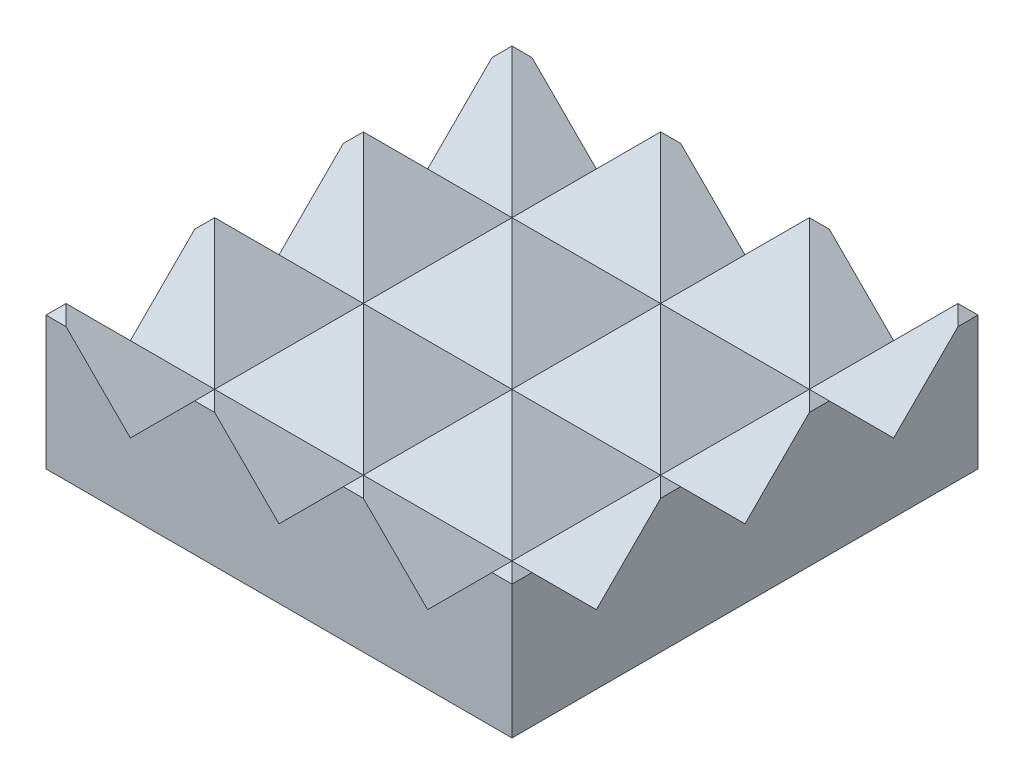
ISO-10303-21;
HEADER;
FILE_DESCRIPTION(('STEP AP214'),'2;1');
FILE_NAME('part.step','',(''),(''),'','','');
FILE_SCHEMA(('AUTOMOTIVE_DESIGN { 1 0 10303 214 1 1 1 1 }'));
ENDSEC;
DATA;
#1=APPLICATION_CONTEXT('core data for automotive mechanical design processes');
#2=APPLICATION_PROTOCOL_DEFINITION('international standard','automotive_design',2000,#1);
#3=PRODUCT_CONTEXT('',#1,'mechanical');
#4=PRODUCT('Part','Part','',(#3));
#5=PRODUCT_RELATED_PRODUCT_CATEGORY('part','',(#4));
#6=PRODUCT_DEFINITION_FORMATION('','',#4);
#7=PRODUCT_DEFINITION_CONTEXT('part definition',#1,'design');
#8=PRODUCT_DEFINITION('design','',#6,#7);
#9=PRODUCT_DEFINITION_SHAPE('','',#8);
#10=(LENGTH_UNIT() NAMED_UNIT(*) SI_UNIT(.MILLI.,.METRE.));
#11=(NAMED_UNIT(*) PLANE_ANGLE_UNIT() SI_UNIT($,.RADIAN.));
#12=(NAMED_UNIT(*) SI_UNIT($,.STERADIAN.) SOLID_ANGLE_UNIT());
#13=UNCERTAINTY_MEASURE_WITH_UNIT(LENGTH_MEASURE(1.E-05),#10,'distance_accuracy_value','');
#14=(GEOMETRIC_REPRESENTATION_CONTEXT(3) GLOBAL_UNCERTAINTY_ASSIGNED_CONTEXT((#13)) GLOBAL_UNIT_ASSIGNED_CONTEXT((#10,
#11,#12)) REPRESENTATION_CONTEXT('',''));
#15=CARTESIAN_POINT('',(0.,0.,0.));
#16=DIRECTION('',(0.,0.,1.));
#17=DIRECTION('',(1.,0.,0.));
#18=AXIS2_PLACEMENT_3D('',#15,#16,#17);
#19=CARTESIAN_POINT('',(-6.08,0.0699999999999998,-4.765));
#20=DIRECTION('',(0.707106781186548,-0.707106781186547,0.));
#21=DIRECTION('',(0.707106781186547,0.707106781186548,0.));
#22=AXIS2_PLACEMENT_3D('',#19,#20,#21);
#23=PLANE('',#22);
#24=DIRECTION('',(0.577350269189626,0.577350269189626,-0.577350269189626));
#25=VECTOR('',#24,1.);
#26=CARTESIAN_POINT('',(-5.505,0.645,-3.615));
#27=LINE('',#26,#25);
#28=CARTESIAN_POINT('',(-4.765,1.385,-4.355));
#29=VERTEX_POINT('',#28);
#30=CARTESIAN_POINT('',(-4.56,1.59,-4.56));
#31=VERTEX_POINT('',#30);
#32=EDGE_CURVE('E302',#29,#31,#27,.T.);
#33=ORIENTED_EDGE('',*,*,#32,.T.);
#34=DIRECTION('',(-0.577350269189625,-0.577350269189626,-0.577350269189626));
#35=VECTOR('',#34,1.);
#36=CARTESIAN_POINT('',(-5.64166666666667,0.508333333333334,-5.64166666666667));
#37=LINE('',#36,#35);
#38=CARTESIAN_POINT('',(-4.765,1.385,-4.765));
#39=VERTEX_POINT('',#38);
#40=EDGE_CURVE('E275',#31,#39,#37,.T.);
#41=ORIENTED_EDGE('',*,*,#40,.T.);
#42=DIRECTION('',(0.,0.,-1.));
#43=VECTOR('',#42,1.);
#44=CARTESIAN_POINT('',(-4.765,1.385,4.765));
#45=LINE('',#44,#43);
#46=EDGE_CURVE('E309',#29,#39,#45,.T.);
#47=ORIENTED_EDGE('',*,*,#46,.F.);
#48=EDGE_LOOP('',(#33,#41,#47));
#49=FACE_BOUND('',#48,.T.);
#50=ADVANCED_FACE('F37',(#49),#23,.F.);
#51=CARTESIAN_POINT('',(-3.04,0.0699999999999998,-4.765));
#52=DIRECTION('',(0.707106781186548,-0.707106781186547,0.));
#53=DIRECTION('',(0.707106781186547,0.707106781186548,0.));
#54=AXIS2_PLACEMENT_3D('',#51,#52,#53);
#55=PLANE('',#54);
#56=DIRECTION('',(0.577350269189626,0.577350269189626,-0.577350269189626));
#57=VECTOR('',#56,1.);
#58=CARTESIAN_POINT('',(-2.465,0.645,-3.615));
#59=LINE('',#58,#57);
#60=CARTESIAN_POINT('',(-3.04,0.0700000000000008,-3.04));
#61=VERTEX_POINT('',#60);
#62=CARTESIAN_POINT('',(-1.52,1.59,-4.56));
#63=VERTEX_POINT('',#62);
#64=EDGE_CURVE('E307',#61,#63,#59,.T.);
#65=ORIENTED_EDGE('',*,*,#64,.T.);
#66=DIRECTION('',(-0.577350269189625,-0.577350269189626,-0.577350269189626));
#67=VECTOR('',#66,1.);
#68=CARTESIAN_POINT('',(-2.60166666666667,0.508333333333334,-5.64166666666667));
#69=LINE('',#68,#67);
#70=CARTESIAN_POINT('',(-1.725,1.385,-4.765));
#71=VERTEX_POINT('',#70);
#72=EDGE_CURVE('E669',#63,#71,#69,.T.);
#73=ORIENTED_EDGE('',*,*,#72,.T.);
#74=DIRECTION('',(0.707106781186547,0.707106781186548,0.));
#75=VECTOR('',#74,1.);
#76=CARTESIAN_POINT('',(-3.04,0.0699999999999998,-4.765));
#77=LINE('',#76,#75);
#78=CARTESIAN_POINT('',(-3.04,0.0699999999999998,-4.765));
#79=VERTEX_POINT('',#78);
#80=EDGE_CURVE('E570',#79,#71,#77,.T.);
#81=ORIENTED_EDGE('',*,*,#80,.F.);
#82=DIRECTION('',(0.,0.,1.));
#83=VECTOR('',#82,1.);
#84=CARTESIAN_POINT('',(-3.04,0.0699999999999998,-4.765));
#85=LINE('',#84,#83);
#86=EDGE_CURVE('E582',#79,#61,#85,.T.);
#87=ORIENTED_EDGE('',*,*,#86,.T.);
#88=EDGE_LOOP('',(#65,#73,#81,#87));
#89=FACE_BOUND('',#88,.T.);
#90=ADVANCED_FACE('F769',(#89),#55,.F.);
#91=CARTESIAN_POINT('',(-4.56,1.59,-4.765));
#92=DIRECTION('',(-0.707106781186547,-0.707106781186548,0.));
#93=DIRECTION('',(0.707106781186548,-0.707106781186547,0.));
#94=AXIS2_PLACEMENT_3D('',#91,#92,#93);
#95=PLANE('',#94);
#96=DIRECTION('',(0.707106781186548,-0.707106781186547,0.));
#97=VECTOR('',#96,1.);
#98=CARTESIAN_POINT('',(-4.56,1.59,-4.765));
#99=LINE('',#98,#97);
#100=CARTESIAN_POINT('',(-4.355,1.385,-4.765));
#101=VERTEX_POINT('',#100);
#102=EDGE_CURVE('E296',#101,#79,#99,.T.);
#103=ORIENTED_EDGE('',*,*,#102,.F.);
#104=DIRECTION('',(-0.577350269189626,0.577350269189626,0.577350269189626));
#105=VECTOR('',#104,1.);
#106=CARTESIAN_POINT('',(-4.49166666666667,1.52166666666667,-4.62833333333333));
#107=LINE('',#106,#105);
#108=EDGE_CURVE('E278',#101,#31,#107,.T.);
#109=ORIENTED_EDGE('',*,*,#108,.T.);
#110=DIRECTION('',(0.577350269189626,-0.577350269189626,0.577350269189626));
#111=VECTOR('',#110,1.);
#112=CARTESIAN_POINT('',(-4.62833333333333,1.65833333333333,-4.62833333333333));
#113=LINE('',#112,#111);
#114=EDGE_CURVE('E294',#31,#61,#113,.T.);
#115=ORIENTED_EDGE('',*,*,#114,.T.);
#116=ORIENTED_EDGE('',*,*,#86,.F.);
#117=EDGE_LOOP('',(#103,#109,#115,#116));
#118=FACE_BOUND('',#117,.T.);
#119=ADVANCED_FACE('F292',(#118),#95,.F.);
#120=CARTESIAN_POINT('',(0.,0.0699999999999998,-4.765));
#121=DIRECTION('',(0.707106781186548,-0.707106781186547,0.));
#122=DIRECTION('',(0.707106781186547,0.707106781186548,0.));
#123=AXIS2_PLACEMENT_3D('',#120,#121,#122);
#124=PLANE('',#123);
#125=DIRECTION('',(0.577350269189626,0.577350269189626,-0.577350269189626));
#126=VECTOR('',#125,1.);
#127=CARTESIAN_POINT('',(0.575000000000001,0.645,-3.615));
#128=LINE('',#127,#126);
#129=CARTESIAN_POINT('',(0.,0.070000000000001,-3.04));
#130=VERTEX_POINT('',#129);
#131=CARTESIAN_POINT('',(1.52,1.59,-4.56));
#132=VERTEX_POINT('',#131);
#133=EDGE_CURVE('E760',#130,#132,#128,.T.);
#134=ORIENTED_EDGE('',*,*,#133,.T.);
#135=DIRECTION('',(-0.577350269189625,-0.577350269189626,-0.577350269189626));
#136=VECTOR('',#135,1.);
#137=CARTESIAN_POINT('',(0.438333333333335,0.508333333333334,-5.64166666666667));
#138=LINE('',#137,#136);
#139=CARTESIAN_POINT('',(1.315,1.385,-4.765));
#140=VERTEX_POINT('',#139);
#141=EDGE_CURVE('E677',#132,#140,#138,.T.);
#142=ORIENTED_EDGE('',*,*,#141,.T.);
#143=DIRECTION('',(0.707106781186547,0.707106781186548,0.));
#144=VECTOR('',#143,1.);
#145=CARTESIAN_POINT('',(0.,0.0699999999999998,-4.765));
#146=LINE('',#145,#144);
#147=CARTESIAN_POINT('',(0.,0.0699999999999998,-4.765));
#148=VERTEX_POINT('',#147);
#149=EDGE_CURVE('E540',#148,#140,#146,.T.);
#150=ORIENTED_EDGE('',*,*,#149,.F.);
#151=DIRECTION('',(0.,0.,1.));
#152=VECTOR('',#151,1.);
#153=CARTESIAN_POINT('',(0.,0.0699999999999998,-4.765));
#154=LINE('',#153,#152);
#155=EDGE_CURVE('E547',#148,#130,#154,.T.);
#156=ORIENTED_EDGE('',*,*,#155,.T.);
#157=EDGE_LOOP('',(#134,#142,#150,#156));
#158=FACE_BOUND('',#157,.T.);
#159=ADVANCED_FACE('F1106',(#158),#124,.F.);
#160=CARTESIAN_POINT('',(-1.52,1.59,-4.765));
#161=DIRECTION('',(-0.707106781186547,-0.707106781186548,0.));
#162=DIRECTION('',(0.707106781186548,-0.707106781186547,0.));
#163=AXIS2_PLACEMENT_3D('',#160,#161,#162);
#164=PLANE('',#163);
#165=DIRECTION('',(0.707106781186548,-0.707106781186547,0.));
#166=VECTOR('',#165,1.);
#167=CARTESIAN_POINT('',(-1.52,1.59,-4.765));
#168=LINE('',#167,#166);
#169=CARTESIAN_POINT('',(-1.315,1.385,-4.765));
#170=VERTEX_POINT('',#169);
#171=EDGE_CURVE('E565',#170,#148,#168,.T.);
#172=ORIENTED_EDGE('',*,*,#171,.F.);
#173=DIRECTION('',(-0.577350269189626,0.577350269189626,0.577350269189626));
#174=VECTOR('',#173,1.);
#175=CARTESIAN_POINT('',(-1.45166666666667,1.52166666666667,-4.62833333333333));
#176=LINE('',#175,#174);
#177=EDGE_CURVE('E684',#170,#63,#176,.T.);
#178=ORIENTED_EDGE('',*,*,#177,.T.);
#179=DIRECTION('',(0.577350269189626,-0.577350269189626,0.577350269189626));
#180=VECTOR('',#179,1.);
#181=CARTESIAN_POINT('',(-1.58833333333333,1.65833333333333,-4.62833333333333));
#182=LINE('',#181,#180);
#183=EDGE_CURVE('E762',#63,#130,#182,.T.);
#184=ORIENTED_EDGE('',*,*,#183,.T.);
#185=ORIENTED_EDGE('',*,*,#155,.F.);
#186=EDGE_LOOP('',(#172,#178,#184,#185));
#187=FACE_BOUND('',#186,.T.);
#188=ADVANCED_FACE('F1098',(#187),#164,.F.);
#189=CARTESIAN_POINT('',(3.04,0.0699999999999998,-4.765));
#190=DIRECTION('',(0.707106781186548,-0.707106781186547,0.));
#191=DIRECTION('',(0.707106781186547,0.707106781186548,0.));
#192=AXIS2_PLACEMENT_3D('',#189,#190,#191);
#193=PLANE('',#192);
#194=DIRECTION('',(0.577350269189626,0.577350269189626,-0.577350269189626));
#195=VECTOR('',#194,1.);
#196=CARTESIAN_POINT('',(3.615,0.645,-3.615));
#197=LINE('',#196,#195);
#198=CARTESIAN_POINT('',(3.04,0.0700000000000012,-3.04));
#199=VERTEX_POINT('',#198);
#200=CARTESIAN_POINT('',(4.56,1.59,-4.56));
#201=VERTEX_POINT('',#200);
#202=EDGE_CURVE('E753',#199,#201,#197,.T.);
#203=ORIENTED_EDGE('',*,*,#202,.T.);
#204=DIRECTION('',(-0.577350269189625,-0.577350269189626,-0.577350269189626));
#205=VECTOR('',#204,1.);
#206=CARTESIAN_POINT('',(3.47833333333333,0.508333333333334,-5.64166666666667));
#207=LINE('',#206,#205);
#208=CARTESIAN_POINT('',(4.355,1.385,-4.765));
#209=VERTEX_POINT('',#208);
#210=EDGE_CURVE('E666',#201,#209,#207,.T.);
#211=ORIENTED_EDGE('',*,*,#210,.T.);
#212=DIRECTION('',(0.707106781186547,0.707106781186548,0.));
#213=VECTOR('',#212,1.);
#214=CARTESIAN_POINT('',(3.04,0.0699999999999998,-4.765));
#215=LINE('',#214,#213);
#216=CARTESIAN_POINT('',(3.04,0.0699999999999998,-4.765));
#217=VERTEX_POINT('',#216);
#218=EDGE_CURVE('E523',#217,#209,#215,.T.);
#219=ORIENTED_EDGE('',*,*,#218,.F.);
#220=DIRECTION('',(0.,0.,1.));
#221=VECTOR('',#220,1.);
#222=CARTESIAN_POINT('',(3.04,0.0699999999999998,-4.765));
#223=LINE('',#222,#221);
#224=EDGE_CURVE('E526',#217,#199,#223,.T.);
#225=ORIENTED_EDGE('',*,*,#224,.T.);
#226=EDGE_LOOP('',(#203,#211,#219,#225));
#227=FACE_BOUND('',#226,.T.);
#228=ADVANCED_FACE('F802',(#227),#193,.F.);
#229=CARTESIAN_POINT('',(1.52,1.59,-4.765));
#230=DIRECTION('',(-0.707106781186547,-0.707106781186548,0.));
#231=DIRECTION('',(0.707106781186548,-0.707106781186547,0.));
#232=AXIS2_PLACEMENT_3D('',#229,#230,#231);
#233=PLANE('',#232);
#234=DIRECTION('',(0.707106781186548,-0.707106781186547,0.));
#235=VECTOR('',#234,1.);
#236=CARTESIAN_POINT('',(1.52,1.59,-4.765));
#237=LINE('',#236,#235);
#238=CARTESIAN_POINT('',(1.725,1.385,-4.765));
#239=VERTEX_POINT('',#238);
#240=EDGE_CURVE('E544',#239,#217,#237,.T.);
#241=ORIENTED_EDGE('',*,*,#240,.F.);
#242=DIRECTION('',(-0.577350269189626,0.577350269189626,0.577350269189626));
#243=VECTOR('',#242,1.);
#244=CARTESIAN_POINT('',(1.58833333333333,1.52166666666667,-4.62833333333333));
#245=LINE('',#244,#243);
#246=EDGE_CURVE('E673',#239,#132,#245,.T.);
#247=ORIENTED_EDGE('',*,*,#246,.T.);
#248=DIRECTION('',(0.577350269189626,-0.577350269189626,0.577350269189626));
#249=VECTOR('',#248,1.);
#250=CARTESIAN_POINT('',(1.45166666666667,1.65833333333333,-4.62833333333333));
#251=LINE('',#250,#249);
#252=EDGE_CURVE('E757',#132,#199,#251,.T.);
#253=ORIENTED_EDGE('',*,*,#252,.T.);
#254=ORIENTED_EDGE('',*,*,#224,.F.);
#255=EDGE_LOOP('',(#241,#247,#253,#254));
#256=FACE_BOUND('',#255,.T.);
#257=ADVANCED_FACE('F806',(#256),#233,.F.);
#258=CARTESIAN_POINT('',(4.56,1.59,-4.765));
#259=DIRECTION('',(-0.707106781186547,-0.707106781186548,0.));
#260=DIRECTION('',(0.707106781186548,-0.707106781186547,0.));
#261=AXIS2_PLACEMENT_3D('',#258,#259,#260);
#262=PLANE('',#261);
#263=DIRECTION('',(0.,0.,1.));
#264=VECTOR('',#263,1.);
#265=CARTESIAN_POINT('',(4.765,1.385,4.765));
#266=LINE('',#265,#264);
#267=CARTESIAN_POINT('',(4.765,1.385,-4.765));
#268=VERTEX_POINT('',#267);
#269=CARTESIAN_POINT('',(4.765,1.385,-4.355));
#270=VERTEX_POINT('',#269);
#271=EDGE_CURVE('E519',#268,#270,#266,.T.);
#272=ORIENTED_EDGE('',*,*,#271,.F.);
#273=DIRECTION('',(-0.577350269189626,0.577350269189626,0.577350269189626));
#274=VECTOR('',#273,1.);
#275=CARTESIAN_POINT('',(4.62833333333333,1.52166666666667,-4.62833333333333));
#276=LINE('',#275,#274);
#277=EDGE_CURVE('E658',#268,#201,#276,.T.);
#278=ORIENTED_EDGE('',*,*,#277,.T.);
#279=DIRECTION('',(0.577350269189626,-0.577350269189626,0.577350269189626));
#280=VECTOR('',#279,1.);
#281=CARTESIAN_POINT('',(4.49166666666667,1.65833333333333,-4.62833333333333));
#282=LINE('',#281,#280);
#283=EDGE_CURVE('E749',#201,#270,#282,.T.);
#284=ORIENTED_EDGE('',*,*,#283,.T.);
#285=EDGE_LOOP('',(#272,#278,#284));
#286=FACE_BOUND('',#285,.T.);
#287=ADVANCED_FACE('F800',(#286),#262,.F.);
#288=DIRECTION('',(0.577350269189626,0.577350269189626,-0.577350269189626));
#289=VECTOR('',#288,1.);
#290=CARTESIAN_POINT('',(-4.49166666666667,1.65833333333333,-1.58833333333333));
#291=LINE('',#290,#289);
#292=CARTESIAN_POINT('',(-4.765,1.385,-1.315));
#293=VERTEX_POINT('',#292);
#294=CARTESIAN_POINT('',(-4.56,1.59,-1.52));
#295=VERTEX_POINT('',#294);
#296=EDGE_CURVE('E398',#293,#295,#291,.T.);
#297=ORIENTED_EDGE('',*,*,#296,.T.);
#298=DIRECTION('',(-0.577350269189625,-0.577350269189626,-0.577350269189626));
#299=VECTOR('',#298,1.);
#300=CARTESIAN_POINT('',(-6.655,-0.505000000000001,-3.615));
#301=LINE('',#300,#299);
#302=CARTESIAN_POINT('',(-4.765,1.385,-1.725));
#303=VERTEX_POINT('',#302);
#304=EDGE_CURVE('E745',#295,#303,#301,.T.);
#305=ORIENTED_EDGE('',*,*,#304,.T.);
#306=EDGE_CURVE('E997',#293,#303,#45,.T.);
#307=ORIENTED_EDGE('',*,*,#306,.F.);
#308=EDGE_LOOP('',(#297,#305,#307));
#309=FACE_BOUND('',#308,.T.);
#310=ADVANCED_FACE('F922',(#309),#23,.F.);
#311=DIRECTION('',(0.577350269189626,0.577350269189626,-0.577350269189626));
#312=VECTOR('',#311,1.);
#313=CARTESIAN_POINT('',(-1.45166666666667,1.65833333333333,-1.58833333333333));
#314=LINE('',#313,#312);
#315=CARTESIAN_POINT('',(-3.04,0.0700000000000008,0.));
#316=VERTEX_POINT('',#315);
#317=CARTESIAN_POINT('',(-1.52,1.59,-1.52));
#318=VERTEX_POINT('',#317);
#319=EDGE_CURVE('E390',#316,#318,#314,.T.);
#320=ORIENTED_EDGE('',*,*,#319,.T.);
#321=DIRECTION('',(-0.577350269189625,-0.577350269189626,-0.577350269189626));
#322=VECTOR('',#321,1.);
#323=CARTESIAN_POINT('',(-3.615,-0.505000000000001,-3.615));
#324=LINE('',#323,#322);
#325=EDGE_CURVE('E738',#318,#61,#324,.T.);
#326=ORIENTED_EDGE('',*,*,#325,.T.);
#327=EDGE_CURVE('E586',#61,#316,#85,.T.);
#328=ORIENTED_EDGE('',*,*,#327,.T.);
#329=EDGE_LOOP('',(#320,#326,#328));
#330=FACE_BOUND('',#329,.T.);
#331=ADVANCED_FACE('F927',(#330),#55,.F.);
#332=ORIENTED_EDGE('',*,*,#327,.F.);
#333=DIRECTION('',(-0.577350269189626,0.577350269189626,0.577350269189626));
#334=VECTOR('',#333,1.);
#335=CARTESIAN_POINT('',(-3.47833333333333,0.508333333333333,-2.60166666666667));
#336=LINE('',#335,#334);
#337=EDGE_CURVE('E741',#61,#295,#336,.T.);
#338=ORIENTED_EDGE('',*,*,#337,.T.);
#339=DIRECTION('',(0.577350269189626,-0.577350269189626,0.577350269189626));
#340=VECTOR('',#339,1.);
#341=CARTESIAN_POINT('',(-5.64166666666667,2.67166666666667,-2.60166666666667));
#342=LINE('',#341,#340);
#343=EDGE_CURVE('E394',#295,#316,#342,.T.);
#344=ORIENTED_EDGE('',*,*,#343,.T.);
#345=EDGE_LOOP('',(#332,#338,#344));
#346=FACE_BOUND('',#345,.T.);
#347=ADVANCED_FACE('F990',(#346),#95,.F.);
#348=DIRECTION('',(0.577350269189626,0.577350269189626,-0.577350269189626));
#349=VECTOR('',#348,1.);
#350=CARTESIAN_POINT('',(1.58833333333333,1.65833333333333,-1.58833333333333));
#351=LINE('',#350,#349);
#352=CARTESIAN_POINT('',(0.,0.0700000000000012,0.));
#353=VERTEX_POINT('',#352);
#354=CARTESIAN_POINT('',(1.52,1.59,-1.52));
#355=VERTEX_POINT('',#354);
#356=EDGE_CURVE('E382',#353,#355,#351,.T.);
#357=ORIENTED_EDGE('',*,*,#356,.T.);
#358=DIRECTION('',(-0.577350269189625,-0.577350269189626,-0.577350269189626));
#359=VECTOR('',#358,1.);
#360=CARTESIAN_POINT('',(-0.574999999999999,-0.505000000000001,-3.615));
#361=LINE('',#360,#359);
#362=EDGE_CURVE('E730',#355,#130,#361,.T.);
#363=ORIENTED_EDGE('',*,*,#362,.T.);
#364=EDGE_CURVE('E552',#130,#353,#154,.T.);
#365=ORIENTED_EDGE('',*,*,#364,.T.);
#366=EDGE_LOOP('',(#357,#363,#365));
#367=FACE_BOUND('',#366,.T.);
#368=ADVANCED_FACE('F1092',(#367),#124,.F.);
#369=ORIENTED_EDGE('',*,*,#364,.F.);
#370=DIRECTION('',(-0.577350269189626,0.577350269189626,0.577350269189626));
#371=VECTOR('',#370,1.);
#372=CARTESIAN_POINT('',(-0.438333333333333,0.508333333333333,-2.60166666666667));
#373=LINE('',#372,#371);
#374=EDGE_CURVE('E734',#130,#318,#373,.T.);
#375=ORIENTED_EDGE('',*,*,#374,.T.);
#376=DIRECTION('',(0.577350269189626,-0.577350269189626,0.577350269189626));
#377=VECTOR('',#376,1.);
#378=CARTESIAN_POINT('',(-2.60166666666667,2.67166666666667,-2.60166666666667));
#379=LINE('',#378,#377);
#380=EDGE_CURVE('E386',#318,#353,#379,.T.);
#381=ORIENTED_EDGE('',*,*,#380,.T.);
#382=EDGE_LOOP('',(#369,#375,#381));
#383=FACE_BOUND('',#382,.T.);
#384=ADVANCED_FACE('F1094',(#383),#164,.F.);
#385=DIRECTION('',(0.577350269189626,0.577350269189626,-0.577350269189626));
#386=VECTOR('',#385,1.);
#387=CARTESIAN_POINT('',(4.62833333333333,1.65833333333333,-1.58833333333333));
#388=LINE('',#387,#386);
#389=CARTESIAN_POINT('',(3.04,0.0700000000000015,0.));
#390=VERTEX_POINT('',#389);
#391=CARTESIAN_POINT('',(4.56,1.59,-1.52));
#392=VERTEX_POINT('',#391);
#393=EDGE_CURVE('E374',#390,#392,#388,.T.);
#394=ORIENTED_EDGE('',*,*,#393,.T.);
#395=DIRECTION('',(-0.577350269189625,-0.577350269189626,-0.577350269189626));
#396=VECTOR('',#395,1.);
#397=CARTESIAN_POINT('',(2.465,-0.505000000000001,-3.615));
#398=LINE('',#397,#396);
#399=EDGE_CURVE('E722',#392,#199,#398,.T.);
#400=ORIENTED_EDGE('',*,*,#399,.T.);
#401=EDGE_CURVE('E531',#199,#390,#223,.T.);
#402=ORIENTED_EDGE('',*,*,#401,.T.);
#403=EDGE_LOOP('',(#394,#400,#402));
#404=FACE_BOUND('',#403,.T.);
#405=ADVANCED_FACE('F809',(#404),#193,.F.);
#406=ORIENTED_EDGE('',*,*,#401,.F.);
#407=DIRECTION('',(-0.577350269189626,0.577350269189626,0.577350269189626));
#408=VECTOR('',#407,1.);
#409=CARTESIAN_POINT('',(2.60166666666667,0.508333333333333,-2.60166666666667));
#410=LINE('',#409,#408);
#411=EDGE_CURVE('E726',#199,#355,#410,.T.);
#412=ORIENTED_EDGE('',*,*,#411,.T.);
#413=DIRECTION('',(0.577350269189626,-0.577350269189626,0.577350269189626));
#414=VECTOR('',#413,1.);
#415=CARTESIAN_POINT('',(0.438333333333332,2.67166666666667,-2.60166666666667));
#416=LINE('',#415,#414);
#417=EDGE_CURVE('E378',#355,#390,#416,.T.);
#418=ORIENTED_EDGE('',*,*,#417,.T.);
#419=EDGE_LOOP('',(#406,#412,#418));
#420=FACE_BOUND('',#419,.T.);
#421=ADVANCED_FACE('F813',(#420),#233,.F.);
#422=CARTESIAN_POINT('',(4.765,1.385,-1.725));
#423=VERTEX_POINT('',#422);
#424=CARTESIAN_POINT('',(4.765,1.385,-1.315));
#425=VERTEX_POINT('',#424);
#426=EDGE_CURVE('E524',#423,#425,#266,.T.);
#427=ORIENTED_EDGE('',*,*,#426,.F.);
#428=DIRECTION('',(-0.577350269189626,0.577350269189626,0.577350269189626));
#429=VECTOR('',#428,1.);
#430=CARTESIAN_POINT('',(5.64166666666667,0.508333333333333,-2.60166666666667));
#431=LINE('',#430,#429);
#432=EDGE_CURVE('E709',#423,#392,#431,.T.);
#433=ORIENTED_EDGE('',*,*,#432,.T.);
#434=DIRECTION('',(0.577350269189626,-0.577350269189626,0.577350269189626));
#435=VECTOR('',#434,1.);
#436=CARTESIAN_POINT('',(3.47833333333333,2.67166666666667,-2.60166666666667));
#437=LINE('',#436,#435);
#438=EDGE_CURVE('E370',#392,#425,#437,.T.);
#439=ORIENTED_EDGE('',*,*,#438,.T.);
#440=EDGE_LOOP('',(#427,#433,#439));
#441=FACE_BOUND('',#440,.T.);
#442=ADVANCED_FACE('F865',(#441),#262,.F.);
#443=DIRECTION('',(0.577350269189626,0.577350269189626,-0.577350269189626));
#444=VECTOR('',#443,1.);
#445=CARTESIAN_POINT('',(-3.47833333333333,2.67166666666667,0.438333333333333));
#446=LINE('',#445,#444);
#447=CARTESIAN_POINT('',(-4.765,1.385,1.725));
#448=VERTEX_POINT('',#447);
#449=CARTESIAN_POINT('',(-4.56,1.59,1.52));
#450=VERTEX_POINT('',#449);
#451=EDGE_CURVE('E480',#448,#450,#446,.T.);
#452=ORIENTED_EDGE('',*,*,#451,.T.);
#453=DIRECTION('',(-0.577350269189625,-0.577350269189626,-0.577350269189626));
#454=VECTOR('',#453,1.);
#455=CARTESIAN_POINT('',(-7.66833333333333,-1.51833333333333,-1.58833333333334));
#456=LINE('',#455,#454);
#457=CARTESIAN_POINT('',(-4.765,1.385,1.315));
#458=VERTEX_POINT('',#457);
#459=EDGE_CURVE('E366',#450,#458,#456,.T.);
#460=ORIENTED_EDGE('',*,*,#459,.T.);
#461=EDGE_CURVE('E592',#448,#458,#45,.T.);
#462=ORIENTED_EDGE('',*,*,#461,.F.);
#463=EDGE_LOOP('',(#452,#460,#462));
#464=FACE_BOUND('',#463,.T.);
#465=ADVANCED_FACE('F932',(#464),#23,.F.);
#466=DIRECTION('',(0.577350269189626,0.577350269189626,-0.577350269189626));
#467=VECTOR('',#466,1.);
#468=CARTESIAN_POINT('',(-0.438333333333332,2.67166666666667,0.438333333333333));
#469=LINE('',#468,#467);
#470=CARTESIAN_POINT('',(-3.04,0.0700000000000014,3.04));
#471=VERTEX_POINT('',#470);
#472=CARTESIAN_POINT('',(-1.52,1.59,1.52));
#473=VERTEX_POINT('',#472);
#474=EDGE_CURVE('E472',#471,#473,#469,.T.);
#475=ORIENTED_EDGE('',*,*,#474,.T.);
#476=DIRECTION('',(-0.577350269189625,-0.577350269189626,-0.577350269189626));
#477=VECTOR('',#476,1.);
#478=CARTESIAN_POINT('',(-4.62833333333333,-1.51833333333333,-1.58833333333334));
#479=LINE('',#478,#477);
#480=EDGE_CURVE('E358',#473,#316,#479,.T.);
#481=ORIENTED_EDGE('',*,*,#480,.T.);
#482=EDGE_CURVE('E970',#316,#471,#85,.T.);
#483=ORIENTED_EDGE('',*,*,#482,.T.);
#484=EDGE_LOOP('',(#475,#481,#483));
#485=FACE_BOUND('',#484,.T.);
#486=ADVANCED_FACE('F939',(#485),#55,.F.);
#487=ORIENTED_EDGE('',*,*,#482,.F.);
#488=DIRECTION('',(-0.577350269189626,0.577350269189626,0.577350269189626));
#489=VECTOR('',#488,1.);
#490=CARTESIAN_POINT('',(-2.465,-0.505,-0.575000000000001));
#491=LINE('',#490,#489);
#492=EDGE_CURVE('E362',#316,#450,#491,.T.);
#493=ORIENTED_EDGE('',*,*,#492,.T.);
#494=DIRECTION('',(0.577350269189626,-0.577350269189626,0.577350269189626));
#495=VECTOR('',#494,1.);
#496=CARTESIAN_POINT('',(-6.655,3.685,-0.574999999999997));
#497=LINE('',#496,#495);
#498=EDGE_CURVE('E476',#450,#471,#497,.T.);
#499=ORIENTED_EDGE('',*,*,#498,.T.);
#500=EDGE_LOOP('',(#487,#493,#499));
#501=FACE_BOUND('',#500,.T.);
#502=ADVANCED_FACE('F947',(#501),#95,.F.);
#503=DIRECTION('',(0.577350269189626,0.577350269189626,-0.577350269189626));
#504=VECTOR('',#503,1.);
#505=CARTESIAN_POINT('',(2.60166666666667,2.67166666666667,0.438333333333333));
#506=LINE('',#505,#504);
#507=CARTESIAN_POINT('',(0.,0.0700000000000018,3.04));
#508=VERTEX_POINT('',#507);
#509=CARTESIAN_POINT('',(1.52,1.59,1.52));
#510=VERTEX_POINT('',#509);
#511=EDGE_CURVE('E464',#508,#510,#506,.T.);
#512=ORIENTED_EDGE('',*,*,#511,.T.);
#513=DIRECTION('',(-0.577350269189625,-0.577350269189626,-0.577350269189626));
#514=VECTOR('',#513,1.);
#515=CARTESIAN_POINT('',(-1.58833333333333,-1.51833333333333,-1.58833333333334));
#516=LINE('',#515,#514);
#517=EDGE_CURVE('E350',#510,#353,#516,.T.);
#518=ORIENTED_EDGE('',*,*,#517,.T.);
#519=EDGE_CURVE('E884',#353,#508,#154,.T.);
#520=ORIENTED_EDGE('',*,*,#519,.T.);
#521=EDGE_LOOP('',(#512,#518,#520));
#522=FACE_BOUND('',#521,.T.);
#523=ADVANCED_FACE('F1085',(#522),#124,.F.);
#524=ORIENTED_EDGE('',*,*,#519,.F.);
#525=DIRECTION('',(-0.577350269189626,0.577350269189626,0.577350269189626));
#526=VECTOR('',#525,1.);
#527=CARTESIAN_POINT('',(0.575000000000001,-0.505,-0.575000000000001));
#528=LINE('',#527,#526);
#529=EDGE_CURVE('E354',#353,#473,#528,.T.);
#530=ORIENTED_EDGE('',*,*,#529,.T.);
#531=DIRECTION('',(0.577350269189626,-0.577350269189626,0.577350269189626));
#532=VECTOR('',#531,1.);
#533=CARTESIAN_POINT('',(-3.615,3.685,-0.574999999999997));
#534=LINE('',#533,#532);
#535=EDGE_CURVE('E468',#473,#508,#534,.T.);
#536=ORIENTED_EDGE('',*,*,#535,.T.);
#537=EDGE_LOOP('',(#524,#530,#536));
#538=FACE_BOUND('',#537,.T.);
#539=ADVANCED_FACE('F1097',(#538),#164,.F.);
#540=DIRECTION('',(0.577350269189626,0.577350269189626,-0.577350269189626));
#541=VECTOR('',#540,1.);
#542=CARTESIAN_POINT('',(5.64166666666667,2.67166666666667,0.438333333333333));
#543=LINE('',#542,#541);
#544=CARTESIAN_POINT('',(3.04,0.0700000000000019,3.04));
#545=VERTEX_POINT('',#544);
#546=CARTESIAN_POINT('',(4.56,1.59,1.52));
#547=VERTEX_POINT('',#546);
#548=EDGE_CURVE('E456',#545,#547,#543,.T.);
#549=ORIENTED_EDGE('',*,*,#548,.T.);
#550=DIRECTION('',(-0.577350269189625,-0.577350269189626,-0.577350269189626));
#551=VECTOR('',#550,1.);
#552=CARTESIAN_POINT('',(1.45166666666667,-1.51833333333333,-1.58833333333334));
#553=LINE('',#552,#551);
#554=EDGE_CURVE('E342',#547,#390,#553,.T.);
#555=ORIENTED_EDGE('',*,*,#554,.T.);
#556=EDGE_CURVE('E816',#390,#545,#223,.T.);
#557=ORIENTED_EDGE('',*,*,#556,.T.);
#558=EDGE_LOOP('',(#549,#555,#557));
#559=FACE_BOUND('',#558,.T.);
#560=ADVANCED_FACE('F1104',(#559),#193,.F.);
#561=ORIENTED_EDGE('',*,*,#556,.F.);
#562=DIRECTION('',(-0.577350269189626,0.577350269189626,0.577350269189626));
#563=VECTOR('',#562,1.);
#564=CARTESIAN_POINT('',(3.615,-0.505,-0.575000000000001));
#565=LINE('',#564,#563);
#566=EDGE_CURVE('E346',#390,#510,#565,.T.);
#567=ORIENTED_EDGE('',*,*,#566,.T.);
#568=DIRECTION('',(0.577350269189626,-0.577350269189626,0.577350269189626));
#569=VECTOR('',#568,1.);
#570=CARTESIAN_POINT('',(-0.575000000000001,3.685,-0.574999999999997));
#571=LINE('',#570,#569);
#572=EDGE_CURVE('E460',#510,#545,#571,.T.);
#573=ORIENTED_EDGE('',*,*,#572,.T.);
#574=EDGE_LOOP('',(#561,#567,#573));
#575=FACE_BOUND('',#574,.T.);
#576=ADVANCED_FACE('F1082',(#575),#233,.F.);
#577=CARTESIAN_POINT('',(4.765,1.385,1.315));
#578=VERTEX_POINT('',#577);
#579=CARTESIAN_POINT('',(4.765,1.385,1.725));
#580=VERTEX_POINT('',#579);
#581=EDGE_CURVE('E850',#578,#580,#266,.T.);
#582=ORIENTED_EDGE('',*,*,#581,.F.);
#583=DIRECTION('',(-0.577350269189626,0.577350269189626,0.577350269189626));
#584=VECTOR('',#583,1.);
#585=CARTESIAN_POINT('',(6.655,-0.505,-0.575000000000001));
#586=LINE('',#585,#584);
#587=EDGE_CURVE('E332',#578,#547,#586,.T.);
#588=ORIENTED_EDGE('',*,*,#587,.T.);
#589=DIRECTION('',(0.577350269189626,-0.577350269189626,0.577350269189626));
#590=VECTOR('',#589,1.);
#591=CARTESIAN_POINT('',(2.465,3.685,-0.574999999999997));
#592=LINE('',#591,#590);
#593=EDGE_CURVE('E609',#547,#580,#592,.T.);
#594=ORIENTED_EDGE('',*,*,#593,.T.);
#595=EDGE_LOOP('',(#582,#588,#594));
#596=FACE_BOUND('',#595,.T.);
#597=ADVANCED_FACE('F856',(#596),#262,.F.);
#598=CARTESIAN_POINT('',(-4.765,1.59,-4.765));
#599=DIRECTION('',(0.,0.,1.));
#600=DIRECTION('',(1.,0.,0.));
#601=AXIS2_PLACEMENT_3D('',#598,#599,#600);
#602=PLANE('',#601);
#603=DIRECTION('',(0.,-1.,0.));
#604=VECTOR('',#603,1.);
#605=CARTESIAN_POINT('',(4.765,1.59,-4.765));
#606=LINE('',#605,#604);
#607=CARTESIAN_POINT('',(4.765,-1.34,-4.765));
#608=VERTEX_POINT('',#607);
#609=EDGE_CURVE('E591',#268,#608,#606,.T.);
#610=ORIENTED_EDGE('',*,*,#609,.T.);
#611=DIRECTION('',(-1.,0.,0.));
#612=VECTOR('',#611,1.);
#613=CARTESIAN_POINT('',(-4.765,-1.34,-4.765));
#614=LINE('',#613,#612);
#615=CARTESIAN_POINT('',(-4.765,-1.34,-4.765));
#616=VERTEX_POINT('',#615);
#617=EDGE_CURVE('E630',#608,#616,#614,.T.);
#618=ORIENTED_EDGE('',*,*,#617,.T.);
#619=DIRECTION('',(0.,-1.,0.));
#620=VECTOR('',#619,1.);
#621=CARTESIAN_POINT('',(-4.765,1.59,-4.765));
#622=LINE('',#621,#620);
#623=EDGE_CURVE('E601',#39,#616,#622,.T.);
#624=ORIENTED_EDGE('',*,*,#623,.F.);
#625=DIRECTION('',(1.,0.,0.));
#626=VECTOR('',#625,1.);
#627=CARTESIAN_POINT('',(-4.765,1.385,-4.765));
#628=LINE('',#627,#626);
#629=EDGE_CURVE('E280',#39,#101,#628,.T.);
#630=ORIENTED_EDGE('',*,*,#629,.T.);
#631=ORIENTED_EDGE('',*,*,#102,.T.);
#632=ORIENTED_EDGE('',*,*,#80,.T.);
#633=EDGE_CURVE('E670',#71,#170,#628,.T.);
#634=ORIENTED_EDGE('',*,*,#633,.T.);
#635=ORIENTED_EDGE('',*,*,#171,.T.);
#636=ORIENTED_EDGE('',*,*,#149,.T.);
#637=EDGE_CURVE('E660',#140,#239,#628,.T.);
#638=ORIENTED_EDGE('',*,*,#637,.T.);
#639=ORIENTED_EDGE('',*,*,#240,.T.);
#640=ORIENTED_EDGE('',*,*,#218,.T.);
#641=EDGE_CURVE('E650',#209,#268,#628,.T.);
#642=ORIENTED_EDGE('',*,*,#641,.T.);
#643=EDGE_LOOP('',(#610,#618,#624,#630,#631,#632,#634,#635,#636,#638,#639,#640,#642));
#644=FACE_BOUND('',#643,.T.);
#645=ADVANCED_FACE('F998',(#644),#602,.F.);
#646=CARTESIAN_POINT('',(-4.765,1.59,4.765));
#647=DIRECTION('',(1.,0.,0.));
#648=DIRECTION('',(0.,0.,-1.));
#649=AXIS2_PLACEMENT_3D('',#646,#647,#648);
#650=PLANE('',#649);
#651=ORIENTED_EDGE('',*,*,#623,.T.);
#652=DIRECTION('',(0.,0.,1.));
#653=VECTOR('',#652,1.);
#654=CARTESIAN_POINT('',(-4.765,-1.34,4.765));
#655=LINE('',#654,#653);
#656=CARTESIAN_POINT('',(-4.765,-1.34,4.765));
#657=VERTEX_POINT('',#656);
#658=EDGE_CURVE('E613',#616,#657,#655,.T.);
#659=ORIENTED_EDGE('',*,*,#658,.T.);
#660=DIRECTION('',(0.,-1.,0.));
#661=VECTOR('',#660,1.);
#662=CARTESIAN_POINT('',(-4.765,1.59,4.765));
#663=LINE('',#662,#661);
#664=CARTESIAN_POINT('',(-4.765,1.385,4.765));
#665=VERTEX_POINT('',#664);
#666=EDGE_CURVE('E598',#665,#657,#663,.T.);
#667=ORIENTED_EDGE('',*,*,#666,.F.);
#668=CARTESIAN_POINT('',(-4.765,1.385,4.355));
#669=VERTEX_POINT('',#668);
#670=EDGE_CURVE('E587',#665,#669,#45,.T.);
#671=ORIENTED_EDGE('',*,*,#670,.T.);
#672=DIRECTION('',(0.,-0.707106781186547,-0.707106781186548));
#673=VECTOR('',#672,1.);
#674=CARTESIAN_POINT('',(-4.765,0.0700000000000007,3.04));
#675=LINE('',#674,#673);
#676=CARTESIAN_POINT('',(-4.765,0.0700000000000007,3.04));
#677=VERTEX_POINT('',#676);
#678=EDGE_CURVE('E403',#669,#677,#675,.T.);
#679=ORIENTED_EDGE('',*,*,#678,.T.);
#680=DIRECTION('',(0.,0.707106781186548,-0.707106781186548));
#681=VECTOR('',#680,1.);
#682=CARTESIAN_POINT('',(-4.765,1.59,1.52));
#683=LINE('',#682,#681);
#684=EDGE_CURVE('E407',#677,#448,#683,.T.);
#685=ORIENTED_EDGE('',*,*,#684,.T.);
#686=ORIENTED_EDGE('',*,*,#461,.T.);
#687=DIRECTION('',(0.,-0.707106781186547,-0.707106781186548));
#688=VECTOR('',#687,1.);
#689=CARTESIAN_POINT('',(-4.765,0.0700000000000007,0.));
#690=LINE('',#689,#688);
#691=CARTESIAN_POINT('',(-4.765,0.0700000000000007,0.));
#692=VERTEX_POINT('',#691);
#693=EDGE_CURVE('E317',#458,#692,#690,.T.);
#694=ORIENTED_EDGE('',*,*,#693,.T.);
#695=DIRECTION('',(0.,0.707106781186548,-0.707106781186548));
#696=VECTOR('',#695,1.);
#697=CARTESIAN_POINT('',(-4.765,1.59,-1.52));
#698=LINE('',#697,#696);
#699=EDGE_CURVE('E311',#692,#293,#698,.T.);
#700=ORIENTED_EDGE('',*,*,#699,.T.);
#701=ORIENTED_EDGE('',*,*,#306,.T.);
#702=DIRECTION('',(0.,-0.707106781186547,-0.707106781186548));
#703=VECTOR('',#702,1.);
#704=CARTESIAN_POINT('',(-4.765,0.0700000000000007,-3.04));
#705=LINE('',#704,#703);
#706=CARTESIAN_POINT('',(-4.765,0.0700000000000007,-3.04));
#707=VERTEX_POINT('',#706);
#708=EDGE_CURVE('E715',#303,#707,#705,.T.);
#709=ORIENTED_EDGE('',*,*,#708,.T.);
#710=DIRECTION('',(0.,0.707106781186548,-0.707106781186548));
#711=VECTOR('',#710,1.);
#712=CARTESIAN_POINT('',(-4.765,1.59,-4.56));
#713=LINE('',#712,#711);
#714=EDGE_CURVE('E286',#707,#29,#713,.T.);
#715=ORIENTED_EDGE('',*,*,#714,.T.);
#716=ORIENTED_EDGE('',*,*,#46,.T.);
#717=EDGE_LOOP('',(#651,#659,#667,#671,#679,#685,#686,#694,#700,#701,#709,#715,#716));
#718=FACE_BOUND('',#717,.T.);
#719=ADVANCED_FACE('F903',(#718),#650,.F.);
#720=CARTESIAN_POINT('',(-4.765,1.59,4.765));
#721=DIRECTION('',(0.,0.,-1.));
#722=DIRECTION('',(-1.,0.,0.));
#723=AXIS2_PLACEMENT_3D('',#720,#721,#722);
#724=PLANE('',#723);
#725=ORIENTED_EDGE('',*,*,#666,.T.);
#726=DIRECTION('',(1.,0.,0.));
#727=VECTOR('',#726,1.);
#728=CARTESIAN_POINT('',(-4.765,-1.34,4.765));
#729=LINE('',#728,#727);
#730=CARTESIAN_POINT('',(4.765,-1.34,4.765));
#731=VERTEX_POINT('',#730);
#732=EDGE_CURVE('E11',#657,#731,#729,.T.);
#733=ORIENTED_EDGE('',*,*,#732,.T.);
#734=DIRECTION('',(0.,-1.,0.));
#735=VECTOR('',#734,1.);
#736=CARTESIAN_POINT('',(4.765,1.59,4.765));
#737=LINE('',#736,#735);
#738=CARTESIAN_POINT('',(4.765,1.385,4.765));
#739=VERTEX_POINT('',#738);
#740=EDGE_CURVE('E595',#739,#731,#737,.T.);
#741=ORIENTED_EDGE('',*,*,#740,.F.);
#742=DIRECTION('',(-1.,0.,0.));
#743=VECTOR('',#742,1.);
#744=CARTESIAN_POINT('',(-4.765,1.385,4.765));
#745=LINE('',#744,#743);
#746=CARTESIAN_POINT('',(4.355,1.385,4.765));
#747=VERTEX_POINT('',#746);
#748=EDGE_CURVE('E488',#739,#747,#745,.T.);
#749=ORIENTED_EDGE('',*,*,#748,.T.);
#750=DIRECTION('',(0.707106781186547,0.707106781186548,0.));
#751=VECTOR('',#750,1.);
#752=CARTESIAN_POINT('',(3.04,0.0699999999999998,4.765));
#753=LINE('',#752,#751);
#754=CARTESIAN_POINT('',(3.04,0.0699999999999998,4.765));
#755=VERTEX_POINT('',#754);
#756=EDGE_CURVE('E530',#755,#747,#753,.T.);
#757=ORIENTED_EDGE('',*,*,#756,.F.);
#758=DIRECTION('',(0.707106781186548,-0.707106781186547,0.));
#759=VECTOR('',#758,1.);
#760=CARTESIAN_POINT('',(1.52,1.59,4.765));
#761=LINE('',#760,#759);
#762=CARTESIAN_POINT('',(1.725,1.385,4.765));
#763=VERTEX_POINT('',#762);
#764=EDGE_CURVE('E536',#763,#755,#761,.T.);
#765=ORIENTED_EDGE('',*,*,#764,.F.);
#766=CARTESIAN_POINT('',(1.315,1.385,4.765));
#767=VERTEX_POINT('',#766);
#768=EDGE_CURVE('E494',#763,#767,#745,.T.);
#769=ORIENTED_EDGE('',*,*,#768,.T.);
#770=DIRECTION('',(0.707106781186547,0.707106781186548,0.));
#771=VECTOR('',#770,1.);
#772=CARTESIAN_POINT('',(0.,0.0699999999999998,4.765));
#773=LINE('',#772,#771);
#774=CARTESIAN_POINT('',(0.,0.0699999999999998,4.765));
#775=VERTEX_POINT('',#774);
#776=EDGE_CURVE('E551',#775,#767,#773,.T.);
#777=ORIENTED_EDGE('',*,*,#776,.F.);
#778=DIRECTION('',(0.707106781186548,-0.707106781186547,0.));
#779=VECTOR('',#778,1.);
#780=CARTESIAN_POINT('',(-1.52,1.59,4.765));
#781=LINE('',#780,#779);
#782=CARTESIAN_POINT('',(-1.315,1.385,4.765));
#783=VERTEX_POINT('',#782);
#784=EDGE_CURVE('E557',#783,#775,#781,.T.);
#785=ORIENTED_EDGE('',*,*,#784,.F.);
#786=CARTESIAN_POINT('',(-1.725,1.385,4.765));
#787=VERTEX_POINT('',#786);
#788=EDGE_CURVE('E510',#783,#787,#745,.T.);
#789=ORIENTED_EDGE('',*,*,#788,.T.);
#790=DIRECTION('',(0.707106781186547,0.707106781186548,0.));
#791=VECTOR('',#790,1.);
#792=CARTESIAN_POINT('',(-3.04,0.0699999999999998,4.765));
#793=LINE('',#792,#791);
#794=CARTESIAN_POINT('',(-3.04,0.0699999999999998,4.765));
#795=VERTEX_POINT('',#794);
#796=EDGE_CURVE('E571',#795,#787,#793,.T.);
#797=ORIENTED_EDGE('',*,*,#796,.F.);
#798=DIRECTION('',(0.707106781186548,-0.707106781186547,0.));
#799=VECTOR('',#798,1.);
#800=CARTESIAN_POINT('',(-4.56,1.59,4.765));
#801=LINE('',#800,#799);
#802=CARTESIAN_POINT('',(-4.355,1.385,4.765));
#803=VERTEX_POINT('',#802);
#804=EDGE_CURVE('E561',#803,#795,#801,.T.);
#805=ORIENTED_EDGE('',*,*,#804,.F.);
#806=EDGE_CURVE('E493',#803,#665,#745,.T.);
#807=ORIENTED_EDGE('',*,*,#806,.T.);
#808=EDGE_LOOP('',(#725,#733,#741,#749,#757,#765,#769,#777,#785,#789,#797,#805,#807));
#809=FACE_BOUND('',#808,.T.);
#810=ADVANCED_FACE('F835',(#809),#724,.F.);
#811=CARTESIAN_POINT('',(4.765,1.59,4.765));
#812=DIRECTION('',(-1.,0.,0.));
#813=DIRECTION('',(0.,0.,1.));
#814=AXIS2_PLACEMENT_3D('',#811,#812,#813);
#815=PLANE('',#814);
#816=ORIENTED_EDGE('',*,*,#740,.T.);
#817=DIRECTION('',(0.,0.,-1.));
#818=VECTOR('',#817,1.);
#819=CARTESIAN_POINT('',(4.765,-1.34,4.765));
#820=LINE('',#819,#818);
#821=EDGE_CURVE('E47',#731,#608,#820,.T.);
#822=ORIENTED_EDGE('',*,*,#821,.T.);
#823=ORIENTED_EDGE('',*,*,#609,.F.);
#824=ORIENTED_EDGE('',*,*,#271,.T.);
#825=DIRECTION('',(0.,0.707106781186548,-0.707106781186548));
#826=VECTOR('',#825,1.);
#827=CARTESIAN_POINT('',(4.765,1.59,-4.56));
#828=LINE('',#827,#826);
#829=CARTESIAN_POINT('',(4.765,0.0700000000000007,-3.04));
#830=VERTEX_POINT('',#829);
#831=EDGE_CURVE('E706',#830,#270,#828,.T.);
#832=ORIENTED_EDGE('',*,*,#831,.F.);
#833=DIRECTION('',(0.,-0.707106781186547,-0.707106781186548));
#834=VECTOR('',#833,1.);
#835=CARTESIAN_POINT('',(4.765,0.0700000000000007,-3.04));
#836=LINE('',#835,#834);
#837=EDGE_CURVE('E703',#423,#830,#836,.T.);
#838=ORIENTED_EDGE('',*,*,#837,.F.);
#839=ORIENTED_EDGE('',*,*,#426,.T.);
#840=DIRECTION('',(0.,0.707106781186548,-0.707106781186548));
#841=VECTOR('',#840,1.);
#842=CARTESIAN_POINT('',(4.765,1.59,-1.52));
#843=LINE('',#842,#841);
#844=CARTESIAN_POINT('',(4.765,0.0700000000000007,0.));
#845=VERTEX_POINT('',#844);
#846=EDGE_CURVE('E328',#845,#425,#843,.T.);
#847=ORIENTED_EDGE('',*,*,#846,.F.);
#848=DIRECTION('',(0.,-0.707106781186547,-0.707106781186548));
#849=VECTOR('',#848,1.);
#850=CARTESIAN_POINT('',(4.765,0.0700000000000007,0.));
#851=LINE('',#850,#849);
#852=EDGE_CURVE('E325',#578,#845,#851,.T.);
#853=ORIENTED_EDGE('',*,*,#852,.F.);
#854=ORIENTED_EDGE('',*,*,#581,.T.);
#855=DIRECTION('',(0.,0.707106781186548,-0.707106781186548));
#856=VECTOR('',#855,1.);
#857=CARTESIAN_POINT('',(4.765,1.59,1.52));
#858=LINE('',#857,#856);
#859=CARTESIAN_POINT('',(4.765,0.0700000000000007,3.04));
#860=VERTEX_POINT('',#859);
#861=EDGE_CURVE('E408',#860,#580,#858,.T.);
#862=ORIENTED_EDGE('',*,*,#861,.F.);
#863=DIRECTION('',(0.,-0.707106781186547,-0.707106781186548));
#864=VECTOR('',#863,1.);
#865=CARTESIAN_POINT('',(4.765,0.0700000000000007,3.04));
#866=LINE('',#865,#864);
#867=CARTESIAN_POINT('',(4.765,1.385,4.355));
#868=VERTEX_POINT('',#867);
#869=EDGE_CURVE('E402',#868,#860,#866,.T.);
#870=ORIENTED_EDGE('',*,*,#869,.F.);
#871=EDGE_CURVE('E525',#868,#739,#266,.T.);
#872=ORIENTED_EDGE('',*,*,#871,.T.);
#873=EDGE_LOOP('',(#816,#822,#823,#824,#832,#838,#839,#847,#853,#854,#862,#870,#872));
#874=FACE_BOUND('',#873,.T.);
#875=ADVANCED_FACE('F798',(#874),#815,.F.);
#876=CARTESIAN_POINT('',(4.765,-1.59,-4.765));
#877=DIRECTION('',(0.,1.,0.));
#878=DIRECTION('',(0.,0.,1.));
#879=AXIS2_PLACEMENT_3D('',#876,#877,#878);
#880=PLANE('',#879);
#881=DIRECTION('',(-1.,0.,0.));
#882=VECTOR('',#881,1.);
#883=CARTESIAN_POINT('',(4.765,-1.59,4.515));
#884=LINE('',#883,#882);
#885=CARTESIAN_POINT('',(4.515,-1.59,4.515));
#886=VERTEX_POINT('',#885);
#887=CARTESIAN_POINT('',(-4.515,-1.59,4.515));
#888=VERTEX_POINT('',#887);
#889=EDGE_CURVE('E617',#886,#888,#884,.T.);
#890=ORIENTED_EDGE('',*,*,#889,.T.);
#891=DIRECTION('',(0.,0.,-1.));
#892=VECTOR('',#891,1.);
#893=CARTESIAN_POINT('',(-4.515,-1.59,-4.765));
#894=LINE('',#893,#892);
#895=CARTESIAN_POINT('',(-4.515,-1.59,-4.515));
#896=VERTEX_POINT('',#895);
#897=EDGE_CURVE('E626',#888,#896,#894,.T.);
#898=ORIENTED_EDGE('',*,*,#897,.T.);
#899=DIRECTION('',(1.,0.,0.));
#900=VECTOR('',#899,1.);
#901=CARTESIAN_POINT('',(4.765,-1.59,-4.515));
#902=LINE('',#901,#900);
#903=CARTESIAN_POINT('',(4.515,-1.59,-4.515));
#904=VERTEX_POINT('',#903);
#905=EDGE_CURVE('E623',#896,#904,#902,.T.);
#906=ORIENTED_EDGE('',*,*,#905,.T.);
#907=DIRECTION('',(0.,0.,1.));
#908=VECTOR('',#907,1.);
#909=CARTESIAN_POINT('',(4.515,-1.59,-4.765));
#910=LINE('',#909,#908);
#911=EDGE_CURVE('E620',#904,#886,#910,.T.);
#912=ORIENTED_EDGE('',*,*,#911,.T.);
#913=EDGE_LOOP('',(#890,#898,#906,#912));
#914=FACE_BOUND('',#913,.T.);
#915=ADVANCED_FACE('F934',(#914),#880,.F.);
#916=DIRECTION('',(0.577350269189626,0.577350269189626,-0.577350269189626));
#917=VECTOR('',#916,1.);
#918=CARTESIAN_POINT('',(-2.465,3.685,2.465));
#919=LINE('',#918,#917);
#920=CARTESIAN_POINT('',(-4.56,1.59,4.56));
#921=VERTEX_POINT('',#920);
#922=EDGE_CURVE('E515',#665,#921,#919,.T.);
#923=ORIENTED_EDGE('',*,*,#922,.T.);
#924=DIRECTION('',(-0.577350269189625,-0.577350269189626,-0.577350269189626));
#925=VECTOR('',#924,1.);
#926=CARTESIAN_POINT('',(-8.68166666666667,-2.53166666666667,0.438333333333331));
#927=LINE('',#926,#925);
#928=EDGE_CURVE('E452',#921,#669,#927,.T.);
#929=ORIENTED_EDGE('',*,*,#928,.T.);
#930=ORIENTED_EDGE('',*,*,#670,.F.);
#931=EDGE_LOOP('',(#923,#929,#930));
#932=FACE_BOUND('',#931,.T.);
#933=ADVANCED_FACE('F900',(#932),#23,.F.);
#934=DIRECTION('',(0.577350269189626,0.577350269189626,-0.577350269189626));
#935=VECTOR('',#934,1.);
#936=CARTESIAN_POINT('',(0.575000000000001,3.685,2.465));
#937=LINE('',#936,#935);
#938=CARTESIAN_POINT('',(-1.52,1.59,4.56));
#939=VERTEX_POINT('',#938);
#940=EDGE_CURVE('E506',#787,#939,#937,.T.);
#941=ORIENTED_EDGE('',*,*,#940,.T.);
#942=DIRECTION('',(-0.577350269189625,-0.577350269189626,-0.577350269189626));
#943=VECTOR('',#942,1.);
#944=CARTESIAN_POINT('',(-5.64166666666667,-2.53166666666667,0.438333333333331));
#945=LINE('',#944,#943);
#946=EDGE_CURVE('E444',#939,#471,#945,.T.);
#947=ORIENTED_EDGE('',*,*,#946,.T.);
#948=EDGE_CURVE('E575',#471,#795,#85,.T.);
#949=ORIENTED_EDGE('',*,*,#948,.T.);
#950=ORIENTED_EDGE('',*,*,#796,.T.);
#951=EDGE_LOOP('',(#941,#947,#949,#950));
#952=FACE_BOUND('',#951,.T.);
#953=ADVANCED_FACE('F891',(#952),#55,.F.);
#954=ORIENTED_EDGE('',*,*,#948,.F.);
#955=DIRECTION('',(-0.577350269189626,0.577350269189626,0.577350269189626));
#956=VECTOR('',#955,1.);
#957=CARTESIAN_POINT('',(-1.45166666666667,-1.51833333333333,1.45166666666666));
#958=LINE('',#957,#956);
#959=EDGE_CURVE('E448',#471,#921,#958,.T.);
#960=ORIENTED_EDGE('',*,*,#959,.T.);
#961=DIRECTION('',(0.577350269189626,-0.577350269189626,0.577350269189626));
#962=VECTOR('',#961,1.);
#963=CARTESIAN_POINT('',(-7.66833333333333,4.69833333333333,1.45166666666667));
#964=LINE('',#963,#962);
#965=EDGE_CURVE('E511',#921,#803,#964,.T.);
#966=ORIENTED_EDGE('',*,*,#965,.T.);
#967=ORIENTED_EDGE('',*,*,#804,.T.);
#968=EDGE_LOOP('',(#954,#960,#966,#967));
#969=FACE_BOUND('',#968,.T.);
#970=ADVANCED_FACE('F894',(#969),#95,.F.);
#971=DIRECTION('',(0.577350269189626,0.577350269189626,-0.577350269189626));
#972=VECTOR('',#971,1.);
#973=CARTESIAN_POINT('',(3.615,3.685,2.465));
#974=LINE('',#973,#972);
#975=CARTESIAN_POINT('',(1.52,1.59,4.56));
#976=VERTEX_POINT('',#975);
#977=EDGE_CURVE('E498',#767,#976,#974,.T.);
#978=ORIENTED_EDGE('',*,*,#977,.T.);
#979=DIRECTION('',(-0.577350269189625,-0.577350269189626,-0.577350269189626));
#980=VECTOR('',#979,1.);
#981=CARTESIAN_POINT('',(-2.60166666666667,-2.53166666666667,0.438333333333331));
#982=LINE('',#981,#980);
#983=EDGE_CURVE('E436',#976,#508,#982,.T.);
#984=ORIENTED_EDGE('',*,*,#983,.T.);
#985=EDGE_CURVE('E553',#508,#775,#154,.T.);
#986=ORIENTED_EDGE('',*,*,#985,.T.);
#987=ORIENTED_EDGE('',*,*,#776,.T.);
#988=EDGE_LOOP('',(#978,#984,#986,#987));
#989=FACE_BOUND('',#988,.T.);
#990=ADVANCED_FACE('F880',(#989),#124,.F.);
#991=ORIENTED_EDGE('',*,*,#985,.F.);
#992=DIRECTION('',(-0.577350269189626,0.577350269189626,0.577350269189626));
#993=VECTOR('',#992,1.);
#994=CARTESIAN_POINT('',(1.58833333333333,-1.51833333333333,1.45166666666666));
#995=LINE('',#994,#993);
#996=EDGE_CURVE('E440',#508,#939,#995,.T.);
#997=ORIENTED_EDGE('',*,*,#996,.T.);
#998=DIRECTION('',(0.577350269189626,-0.577350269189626,0.577350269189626));
#999=VECTOR('',#998,1.);
#1000=CARTESIAN_POINT('',(-4.62833333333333,4.69833333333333,1.45166666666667));
#1001=LINE('',#1000,#999);
#1002=EDGE_CURVE('E502',#939,#783,#1001,.T.);
#1003=ORIENTED_EDGE('',*,*,#1002,.T.);
#1004=ORIENTED_EDGE('',*,*,#784,.T.);
#1005=EDGE_LOOP('',(#991,#997,#1003,#1004));
#1006=FACE_BOUND('',#1005,.T.);
#1007=ADVANCED_FACE('F885',(#1006),#164,.F.);
#1008=DIRECTION('',(0.577350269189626,0.577350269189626,-0.577350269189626));
#1009=VECTOR('',#1008,1.);
#1010=CARTESIAN_POINT('',(6.655,3.685,2.465));
#1011=LINE('',#1010,#1009);
#1012=CARTESIAN_POINT('',(4.56,1.59,4.56));
#1013=VERTEX_POINT('',#1012);
#1014=EDGE_CURVE('E484',#747,#1013,#1011,.T.);
#1015=ORIENTED_EDGE('',*,*,#1014,.T.);
#1016=DIRECTION('',(-0.577350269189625,-0.577350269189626,-0.577350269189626));
#1017=VECTOR('',#1016,1.);
#1018=CARTESIAN_POINT('',(0.438333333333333,-2.53166666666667,0.438333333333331));
#1019=LINE('',#1018,#1017);
#1020=EDGE_CURVE('E428',#1013,#545,#1019,.T.);
#1021=ORIENTED_EDGE('',*,*,#1020,.T.);
#1022=EDGE_CURVE('E532',#545,#755,#223,.T.);
#1023=ORIENTED_EDGE('',*,*,#1022,.T.);
#1024=ORIENTED_EDGE('',*,*,#756,.T.);
#1025=EDGE_LOOP('',(#1015,#1021,#1023,#1024));
#1026=FACE_BOUND('',#1025,.T.);
#1027=ADVANCED_FACE('F828',(#1026),#193,.F.);
#1028=ORIENTED_EDGE('',*,*,#1022,.F.);
#1029=DIRECTION('',(-0.577350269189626,0.577350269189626,0.577350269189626));
#1030=VECTOR('',#1029,1.);
#1031=CARTESIAN_POINT('',(4.62833333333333,-1.51833333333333,1.45166666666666));
#1032=LINE('',#1031,#1030);
#1033=EDGE_CURVE('E432',#545,#976,#1032,.T.);
#1034=ORIENTED_EDGE('',*,*,#1033,.T.);
#1035=DIRECTION('',(0.577350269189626,-0.577350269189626,0.577350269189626));
#1036=VECTOR('',#1035,1.);
#1037=CARTESIAN_POINT('',(-1.58833333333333,4.69833333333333,1.45166666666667));
#1038=LINE('',#1037,#1036);
#1039=EDGE_CURVE('E492',#976,#763,#1038,.T.);
#1040=ORIENTED_EDGE('',*,*,#1039,.T.);
#1041=ORIENTED_EDGE('',*,*,#764,.T.);
#1042=EDGE_LOOP('',(#1028,#1034,#1040,#1041));
#1043=FACE_BOUND('',#1042,.T.);
#1044=ADVANCED_FACE('F832',(#1043),#233,.F.);
#1045=ORIENTED_EDGE('',*,*,#871,.F.);
#1046=DIRECTION('',(-0.577350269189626,0.577350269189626,0.577350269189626));
#1047=VECTOR('',#1046,1.);
#1048=CARTESIAN_POINT('',(7.66833333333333,-1.51833333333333,1.45166666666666));
#1049=LINE('',#1048,#1047);
#1050=EDGE_CURVE('E423',#868,#1013,#1049,.T.);
#1051=ORIENTED_EDGE('',*,*,#1050,.T.);
#1052=DIRECTION('',(0.577350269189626,-0.577350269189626,0.577350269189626));
#1053=VECTOR('',#1052,1.);
#1054=CARTESIAN_POINT('',(1.45166666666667,4.69833333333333,1.45166666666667));
#1055=LINE('',#1054,#1053);
#1056=EDGE_CURVE('E605',#1013,#739,#1055,.T.);
#1057=ORIENTED_EDGE('',*,*,#1056,.T.);
#1058=EDGE_LOOP('',(#1045,#1051,#1057));
#1059=FACE_BOUND('',#1058,.T.);
#1060=ADVANCED_FACE('F842',(#1059),#262,.F.);
#1061=CARTESIAN_POINT('',(-4.765,1.59,4.56));
#1062=DIRECTION('',(0.,-0.707106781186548,-0.707106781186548));
#1063=DIRECTION('',(0.,0.707106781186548,-0.707106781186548));
#1064=AXIS2_PLACEMENT_3D('',#1061,#1062,#1063);
#1065=PLANE('',#1064);
#1066=ORIENTED_EDGE('',*,*,#1056,.F.);
#1067=ORIENTED_EDGE('',*,*,#1014,.F.);
#1068=ORIENTED_EDGE('',*,*,#748,.F.);
#1069=EDGE_LOOP('',(#1066,#1067,#1068));
#1070=FACE_BOUND('',#1069,.T.);
#1071=ADVANCED_FACE('F839',(#1070),#1065,.F.);
#1072=ORIENTED_EDGE('',*,*,#1039,.F.);
#1073=ORIENTED_EDGE('',*,*,#977,.F.);
#1074=ORIENTED_EDGE('',*,*,#768,.F.);
#1075=EDGE_LOOP('',(#1072,#1073,#1074));
#1076=FACE_BOUND('',#1075,.T.);
#1077=ADVANCED_FACE('F1313',(#1076),#1065,.F.);
#1078=ORIENTED_EDGE('',*,*,#1002,.F.);
#1079=ORIENTED_EDGE('',*,*,#940,.F.);
#1080=ORIENTED_EDGE('',*,*,#788,.F.);
#1081=EDGE_LOOP('',(#1078,#1079,#1080));
#1082=FACE_BOUND('',#1081,.T.);
#1083=ADVANCED_FACE('F889',(#1082),#1065,.F.);
#1084=ORIENTED_EDGE('',*,*,#965,.F.);
#1085=ORIENTED_EDGE('',*,*,#922,.F.);
#1086=ORIENTED_EDGE('',*,*,#806,.F.);
#1087=EDGE_LOOP('',(#1084,#1085,#1086));
#1088=FACE_BOUND('',#1087,.T.);
#1089=ADVANCED_FACE('F898',(#1088),#1065,.F.);
#1090=CARTESIAN_POINT('',(-4.765,0.0700000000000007,3.04));
#1091=DIRECTION('',(0.,-0.707106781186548,0.707106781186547));
#1092=DIRECTION('',(0.,-0.707106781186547,-0.707106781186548));
#1093=AXIS2_PLACEMENT_3D('',#1090,#1091,#1092);
#1094=PLANE('',#1093);
#1095=ORIENTED_EDGE('',*,*,#1050,.F.);
#1096=ORIENTED_EDGE('',*,*,#869,.T.);
#1097=DIRECTION('',(1.,0.,0.));
#1098=VECTOR('',#1097,1.);
#1099=CARTESIAN_POINT('',(-4.765,0.0700000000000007,3.04));
#1100=LINE('',#1099,#1098);
#1101=EDGE_CURVE('E412',#545,#860,#1100,.T.);
#1102=ORIENTED_EDGE('',*,*,#1101,.F.);
#1103=ORIENTED_EDGE('',*,*,#1020,.F.);
#1104=EDGE_LOOP('',(#1095,#1096,#1102,#1103));
#1105=FACE_BOUND('',#1104,.T.);
#1106=ADVANCED_FACE('F845',(#1105),#1094,.F.);
#1107=CARTESIAN_POINT('',(-4.765,1.59,1.52));
#1108=DIRECTION('',(0.,-0.707106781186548,-0.707106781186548));
#1109=DIRECTION('',(0.,0.707106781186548,-0.707106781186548));
#1110=AXIS2_PLACEMENT_3D('',#1107,#1108,#1109);
#1111=PLANE('',#1110);
#1112=ORIENTED_EDGE('',*,*,#1101,.T.);
#1113=ORIENTED_EDGE('',*,*,#861,.T.);
#1114=ORIENTED_EDGE('',*,*,#593,.F.);
#1115=ORIENTED_EDGE('',*,*,#548,.F.);
#1116=EDGE_LOOP('',(#1112,#1113,#1114,#1115));
#1117=FACE_BOUND('',#1116,.T.);
#1118=ADVANCED_FACE('F853',(#1117),#1111,.F.);
#1119=ORIENTED_EDGE('',*,*,#1033,.F.);
#1120=EDGE_CURVE('E967',#508,#545,#1100,.T.);
#1121=ORIENTED_EDGE('',*,*,#1120,.F.);
#1122=ORIENTED_EDGE('',*,*,#983,.F.);
#1123=EDGE_LOOP('',(#1119,#1121,#1122));
#1124=FACE_BOUND('',#1123,.T.);
#1125=ADVANCED_FACE('F1066',(#1124),#1094,.F.);
#1126=ORIENTED_EDGE('',*,*,#1120,.T.);
#1127=ORIENTED_EDGE('',*,*,#572,.F.);
#1128=ORIENTED_EDGE('',*,*,#511,.F.);
#1129=EDGE_LOOP('',(#1126,#1127,#1128));
#1130=FACE_BOUND('',#1129,.T.);
#1131=ADVANCED_FACE('F1065',(#1130),#1111,.F.);
#1132=ORIENTED_EDGE('',*,*,#996,.F.);
#1133=EDGE_CURVE('E424',#471,#508,#1100,.T.);
#1134=ORIENTED_EDGE('',*,*,#1133,.F.);
#1135=ORIENTED_EDGE('',*,*,#946,.F.);
#1136=EDGE_LOOP('',(#1132,#1134,#1135));
#1137=FACE_BOUND('',#1136,.T.);
#1138=ADVANCED_FACE('F965',(#1137),#1094,.F.);
#1139=ORIENTED_EDGE('',*,*,#1133,.T.);
#1140=ORIENTED_EDGE('',*,*,#535,.F.);
#1141=ORIENTED_EDGE('',*,*,#474,.F.);
#1142=EDGE_LOOP('',(#1139,#1140,#1141));
#1143=FACE_BOUND('',#1142,.T.);
#1144=ADVANCED_FACE('F963',(#1143),#1111,.F.);
#1145=ORIENTED_EDGE('',*,*,#684,.F.);
#1146=EDGE_CURVE('E419',#677,#471,#1100,.T.);
#1147=ORIENTED_EDGE('',*,*,#1146,.T.);
#1148=ORIENTED_EDGE('',*,*,#498,.F.);
#1149=ORIENTED_EDGE('',*,*,#451,.F.);
#1150=EDGE_LOOP('',(#1145,#1147,#1148,#1149));
#1151=FACE_BOUND('',#1150,.T.);
#1152=ADVANCED_FACE('F955',(#1151),#1111,.F.);
#1153=ORIENTED_EDGE('',*,*,#959,.F.);
#1154=ORIENTED_EDGE('',*,*,#1146,.F.);
#1155=ORIENTED_EDGE('',*,*,#678,.F.);
#1156=ORIENTED_EDGE('',*,*,#928,.F.);
#1157=EDGE_LOOP('',(#1153,#1154,#1155,#1156));
#1158=FACE_BOUND('',#1157,.T.);
#1159=ADVANCED_FACE('F957',(#1158),#1094,.F.);
#1160=CARTESIAN_POINT('',(-4.765,0.0700000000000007,0.));
#1161=DIRECTION('',(0.,-0.707106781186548,0.707106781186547));
#1162=DIRECTION('',(0.,-0.707106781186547,-0.707106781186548));
#1163=AXIS2_PLACEMENT_3D('',#1160,#1161,#1162);
#1164=PLANE('',#1163);
#1165=ORIENTED_EDGE('',*,*,#587,.F.);
#1166=ORIENTED_EDGE('',*,*,#852,.T.);
#1167=DIRECTION('',(1.,0.,0.));
#1168=VECTOR('',#1167,1.);
#1169=CARTESIAN_POINT('',(-4.765,0.0700000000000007,0.));
#1170=LINE('',#1169,#1168);
#1171=EDGE_CURVE('E327',#390,#845,#1170,.T.);
#1172=ORIENTED_EDGE('',*,*,#1171,.F.);
#1173=ORIENTED_EDGE('',*,*,#554,.F.);
#1174=EDGE_LOOP('',(#1165,#1166,#1172,#1173));
#1175=FACE_BOUND('',#1174,.T.);
#1176=ADVANCED_FACE('F858',(#1175),#1164,.F.);
#1177=CARTESIAN_POINT('',(-4.765,1.59,-1.52));
#1178=DIRECTION('',(0.,-0.707106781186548,-0.707106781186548));
#1179=DIRECTION('',(0.,0.707106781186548,-0.707106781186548));
#1180=AXIS2_PLACEMENT_3D('',#1177,#1178,#1179);
#1181=PLANE('',#1180);
#1182=ORIENTED_EDGE('',*,*,#1171,.T.);
#1183=ORIENTED_EDGE('',*,*,#846,.T.);
#1184=ORIENTED_EDGE('',*,*,#438,.F.);
#1185=ORIENTED_EDGE('',*,*,#393,.F.);
#1186=EDGE_LOOP('',(#1182,#1183,#1184,#1185));
#1187=FACE_BOUND('',#1186,.T.);
#1188=ADVANCED_FACE('F863',(#1187),#1181,.F.);
#1189=ORIENTED_EDGE('',*,*,#492,.F.);
#1190=EDGE_CURVE('E321',#692,#316,#1170,.T.);
#1191=ORIENTED_EDGE('',*,*,#1190,.F.);
#1192=ORIENTED_EDGE('',*,*,#693,.F.);
#1193=ORIENTED_EDGE('',*,*,#459,.F.);
#1194=EDGE_LOOP('',(#1189,#1191,#1192,#1193));
#1195=FACE_BOUND('',#1194,.T.);
#1196=ADVANCED_FACE('F974',(#1195),#1164,.F.);
#1197=ORIENTED_EDGE('',*,*,#699,.F.);
#1198=ORIENTED_EDGE('',*,*,#1190,.T.);
#1199=ORIENTED_EDGE('',*,*,#343,.F.);
#1200=ORIENTED_EDGE('',*,*,#296,.F.);
#1201=EDGE_LOOP('',(#1197,#1198,#1199,#1200));
#1202=FACE_BOUND('',#1201,.T.);
#1203=ADVANCED_FACE('F994',(#1202),#1181,.F.);
#1204=ORIENTED_EDGE('',*,*,#566,.F.);
#1205=EDGE_CURVE('E986',#353,#390,#1170,.T.);
#1206=ORIENTED_EDGE('',*,*,#1205,.F.);
#1207=ORIENTED_EDGE('',*,*,#517,.F.);
#1208=EDGE_LOOP('',(#1204,#1206,#1207));
#1209=FACE_BOUND('',#1208,.T.);
#1210=ADVANCED_FACE('F1041',(#1209),#1164,.F.);
#1211=ORIENTED_EDGE('',*,*,#1205,.T.);
#1212=ORIENTED_EDGE('',*,*,#417,.F.);
#1213=ORIENTED_EDGE('',*,*,#356,.F.);
#1214=EDGE_LOOP('',(#1211,#1212,#1213));
#1215=FACE_BOUND('',#1214,.T.);
#1216=ADVANCED_FACE('F1045',(#1215),#1181,.F.);
#1217=EDGE_CURVE('E326',#316,#353,#1170,.T.);
#1218=ORIENTED_EDGE('',*,*,#1217,.T.);
#1219=ORIENTED_EDGE('',*,*,#380,.F.);
#1220=ORIENTED_EDGE('',*,*,#319,.F.);
#1221=EDGE_LOOP('',(#1218,#1219,#1220));
#1222=FACE_BOUND('',#1221,.T.);
#1223=ADVANCED_FACE('F980',(#1222),#1181,.F.);
#1224=ORIENTED_EDGE('',*,*,#529,.F.);
#1225=ORIENTED_EDGE('',*,*,#1217,.F.);
#1226=ORIENTED_EDGE('',*,*,#480,.F.);
#1227=EDGE_LOOP('',(#1224,#1225,#1226));
#1228=FACE_BOUND('',#1227,.T.);
#1229=ADVANCED_FACE('F984',(#1228),#1164,.F.);
#1230=CARTESIAN_POINT('',(-4.765,0.0700000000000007,-3.04));
#1231=DIRECTION('',(0.,-0.707106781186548,0.707106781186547));
#1232=DIRECTION('',(0.,-0.707106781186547,-0.707106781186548));
#1233=AXIS2_PLACEMENT_3D('',#1230,#1231,#1232);
#1234=PLANE('',#1233);
#1235=ORIENTED_EDGE('',*,*,#432,.F.);
#1236=ORIENTED_EDGE('',*,*,#837,.T.);
#1237=DIRECTION('',(1.,0.,0.));
#1238=VECTOR('',#1237,1.);
#1239=CARTESIAN_POINT('',(-4.765,0.0700000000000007,-3.04));
#1240=LINE('',#1239,#1238);
#1241=EDGE_CURVE('E705',#199,#830,#1240,.T.);
#1242=ORIENTED_EDGE('',*,*,#1241,.F.);
#1243=ORIENTED_EDGE('',*,*,#399,.F.);
#1244=EDGE_LOOP('',(#1235,#1236,#1242,#1243));
#1245=FACE_BOUND('',#1244,.T.);
#1246=ADVANCED_FACE('F796',(#1245),#1234,.F.);
#1247=CARTESIAN_POINT('',(-4.765,1.59,-4.56));
#1248=DIRECTION('',(0.,-0.707106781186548,-0.707106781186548));
#1249=DIRECTION('',(0.,0.707106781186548,-0.707106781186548));
#1250=AXIS2_PLACEMENT_3D('',#1247,#1248,#1249);
#1251=PLANE('',#1250);
#1252=ORIENTED_EDGE('',*,*,#1241,.T.);
#1253=ORIENTED_EDGE('',*,*,#831,.T.);
#1254=ORIENTED_EDGE('',*,*,#283,.F.);
#1255=ORIENTED_EDGE('',*,*,#202,.F.);
#1256=EDGE_LOOP('',(#1252,#1253,#1254,#1255));
#1257=FACE_BOUND('',#1256,.T.);
#1258=ADVANCED_FACE('F791',(#1257),#1251,.F.);
#1259=ORIENTED_EDGE('',*,*,#337,.F.);
#1260=EDGE_CURVE('E304',#707,#61,#1240,.T.);
#1261=ORIENTED_EDGE('',*,*,#1260,.F.);
#1262=ORIENTED_EDGE('',*,*,#708,.F.);
#1263=ORIENTED_EDGE('',*,*,#304,.F.);
#1264=EDGE_LOOP('',(#1259,#1261,#1262,#1263));
#1265=FACE_BOUND('',#1264,.T.);
#1266=ADVANCED_FACE('F1022',(#1265),#1234,.F.);
#1267=ORIENTED_EDGE('',*,*,#714,.F.);
#1268=ORIENTED_EDGE('',*,*,#1260,.T.);
#1269=ORIENTED_EDGE('',*,*,#114,.F.);
#1270=ORIENTED_EDGE('',*,*,#32,.F.);
#1271=EDGE_LOOP('',(#1267,#1268,#1269,#1270));
#1272=FACE_BOUND('',#1271,.T.);
#1273=ADVANCED_FACE('F301',(#1272),#1251,.F.);
#1274=ORIENTED_EDGE('',*,*,#411,.F.);
#1275=EDGE_CURVE('E780',#130,#199,#1240,.T.);
#1276=ORIENTED_EDGE('',*,*,#1275,.F.);
#1277=ORIENTED_EDGE('',*,*,#362,.F.);
#1278=EDGE_LOOP('',(#1274,#1276,#1277));
#1279=FACE_BOUND('',#1278,.T.);
#1280=ADVANCED_FACE('F1021',(#1279),#1234,.F.);
#1281=ORIENTED_EDGE('',*,*,#1275,.T.);
#1282=ORIENTED_EDGE('',*,*,#252,.F.);
#1283=ORIENTED_EDGE('',*,*,#133,.F.);
#1284=EDGE_LOOP('',(#1281,#1282,#1283));
#1285=FACE_BOUND('',#1284,.T.);
#1286=ADVANCED_FACE('F1026',(#1285),#1251,.F.);
#1287=EDGE_CURVE('E704',#61,#130,#1240,.T.);
#1288=ORIENTED_EDGE('',*,*,#1287,.T.);
#1289=ORIENTED_EDGE('',*,*,#183,.F.);
#1290=ORIENTED_EDGE('',*,*,#64,.F.);
#1291=EDGE_LOOP('',(#1288,#1289,#1290));
#1292=FACE_BOUND('',#1291,.T.);
#1293=ADVANCED_FACE('F774',(#1292),#1251,.F.);
#1294=ORIENTED_EDGE('',*,*,#374,.F.);
#1295=ORIENTED_EDGE('',*,*,#1287,.F.);
#1296=ORIENTED_EDGE('',*,*,#325,.F.);
#1297=EDGE_LOOP('',(#1294,#1295,#1296));
#1298=FACE_BOUND('',#1297,.T.);
#1299=ADVANCED_FACE('F777',(#1298),#1234,.F.);
#1300=CARTESIAN_POINT('',(-4.765,0.0700000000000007,-6.08));
#1301=DIRECTION('',(0.,-0.707106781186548,0.707106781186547));
#1302=DIRECTION('',(0.,-0.707106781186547,-0.707106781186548));
#1303=AXIS2_PLACEMENT_3D('',#1300,#1301,#1302);
#1304=PLANE('',#1303);
#1305=ORIENTED_EDGE('',*,*,#277,.F.);
#1306=ORIENTED_EDGE('',*,*,#641,.F.);
#1307=ORIENTED_EDGE('',*,*,#210,.F.);
#1308=EDGE_LOOP('',(#1305,#1306,#1307));
#1309=FACE_BOUND('',#1308,.T.);
#1310=ADVANCED_FACE('F1007',(#1309),#1304,.F.);
#1311=ORIENTED_EDGE('',*,*,#246,.F.);
#1312=ORIENTED_EDGE('',*,*,#637,.F.);
#1313=ORIENTED_EDGE('',*,*,#141,.F.);
#1314=EDGE_LOOP('',(#1311,#1312,#1313));
#1315=FACE_BOUND('',#1314,.T.);
#1316=ADVANCED_FACE('F1011',(#1315),#1304,.F.);
#1317=ORIENTED_EDGE('',*,*,#177,.F.);
#1318=ORIENTED_EDGE('',*,*,#633,.F.);
#1319=ORIENTED_EDGE('',*,*,#72,.F.);
#1320=EDGE_LOOP('',(#1317,#1318,#1319));
#1321=FACE_BOUND('',#1320,.T.);
#1322=ADVANCED_FACE('F1005',(#1321),#1304,.F.);
#1323=ORIENTED_EDGE('',*,*,#108,.F.);
#1324=ORIENTED_EDGE('',*,*,#629,.F.);
#1325=ORIENTED_EDGE('',*,*,#40,.F.);
#1326=EDGE_LOOP('',(#1323,#1324,#1325));
#1327=FACE_BOUND('',#1326,.T.);
#1328=ADVANCED_FACE('F277',(#1327),#1304,.F.);
#1329=CARTESIAN_POINT('',(4.765,-1.34,4.765));
#1330=DIRECTION('',(-0.707106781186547,0.707106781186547,0.));
#1331=DIRECTION('',(-0.707106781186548,-0.707106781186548,0.));
#1332=AXIS2_PLACEMENT_3D('',#1329,#1330,#1331);
#1333=PLANE('',#1332);
#1334=DIRECTION('',(0.577350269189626,0.577350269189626,0.577350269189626));
#1335=VECTOR('',#1334,1.);
#1336=CARTESIAN_POINT('',(1.58833333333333,-4.51666666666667,1.58833333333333));
#1337=LINE('',#1336,#1335);
#1338=EDGE_CURVE('E640',#886,#731,#1337,.T.);
#1339=ORIENTED_EDGE('',*,*,#1338,.F.);
#1340=ORIENTED_EDGE('',*,*,#911,.F.);
#1341=DIRECTION('',(0.577350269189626,0.577350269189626,-0.577350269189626));
#1342=VECTOR('',#1341,1.);
#1343=CARTESIAN_POINT('',(1.58833333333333,-4.51666666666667,-1.58833333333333));
#1344=LINE('',#1343,#1342);
#1345=EDGE_CURVE('E41',#608,#904,#1344,.F.);
#1346=ORIENTED_EDGE('',*,*,#1345,.F.);
#1347=ORIENTED_EDGE('',*,*,#821,.F.);
#1348=EDGE_LOOP('',(#1339,#1340,#1346,#1347));
#1349=FACE_BOUND('',#1348,.T.);
#1350=ADVANCED_FACE('F39',(#1349),#1333,.F.);
#1351=CARTESIAN_POINT('',(-4.765,-1.34,-4.765));
#1352=DIRECTION('',(0.,0.707106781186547,0.707106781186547));
#1353=DIRECTION('',(0.,-0.707106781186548,0.707106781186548));
#1354=AXIS2_PLACEMENT_3D('',#1351,#1352,#1353);
#1355=PLANE('',#1354);
#1356=ORIENTED_EDGE('',*,*,#1345,.T.);
#1357=ORIENTED_EDGE('',*,*,#905,.F.);
#1358=DIRECTION('',(-0.577350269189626,0.577350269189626,-0.577350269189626));
#1359=VECTOR('',#1358,1.);
#1360=CARTESIAN_POINT('',(-4.765,-1.34,-4.765));
#1361=LINE('',#1360,#1359);
#1362=EDGE_CURVE('E638',#616,#896,#1361,.F.);
#1363=ORIENTED_EDGE('',*,*,#1362,.F.);
#1364=ORIENTED_EDGE('',*,*,#617,.F.);
#1365=EDGE_LOOP('',(#1356,#1357,#1363,#1364));
#1366=FACE_BOUND('',#1365,.T.);
#1367=ADVANCED_FACE('F913',(#1366),#1355,.F.);
#1368=CARTESIAN_POINT('',(-4.765,-1.34,4.765));
#1369=DIRECTION('',(0.,0.707106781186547,-0.707106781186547));
#1370=DIRECTION('',(0.,0.707106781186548,0.707106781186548));
#1371=AXIS2_PLACEMENT_3D('',#1368,#1369,#1370);
#1372=PLANE('',#1371);
#1373=ORIENTED_EDGE('',*,*,#1338,.T.);
#1374=ORIENTED_EDGE('',*,*,#732,.F.);
#1375=DIRECTION('',(0.577350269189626,-0.577350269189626,-0.577350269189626));
#1376=VECTOR('',#1375,1.);
#1377=CARTESIAN_POINT('',(-4.765,-1.34,4.765));
#1378=LINE('',#1377,#1376);
#1379=EDGE_CURVE('E635',#888,#657,#1378,.F.);
#1380=ORIENTED_EDGE('',*,*,#1379,.F.);
#1381=ORIENTED_EDGE('',*,*,#889,.F.);
#1382=EDGE_LOOP('',(#1373,#1374,#1380,#1381));
#1383=FACE_BOUND('',#1382,.T.);
#1384=ADVANCED_FACE('F911',(#1383),#1372,.F.);
#1385=CARTESIAN_POINT('',(-4.765,-1.34,4.765));
#1386=DIRECTION('',(0.707106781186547,0.707106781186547,0.));
#1387=DIRECTION('',(-0.707106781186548,0.707106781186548,0.));
#1388=AXIS2_PLACEMENT_3D('',#1385,#1386,#1387);
#1389=PLANE('',#1388);
#1390=ORIENTED_EDGE('',*,*,#1362,.T.);
#1391=ORIENTED_EDGE('',*,*,#897,.F.);
#1392=ORIENTED_EDGE('',*,*,#1379,.T.);
#1393=ORIENTED_EDGE('',*,*,#658,.F.);
#1394=EDGE_LOOP('',(#1390,#1391,#1392,#1393));
#1395=FACE_BOUND('',#1394,.T.);
#1396=ADVANCED_FACE('F908',(#1395),#1389,.F.);
#1397=CLOSED_SHELL('',(#50,#90,#119,#159,#188,#228,#257,#287,#310,#331,#347,#368,#384,#405,#421,
#442,#465,#486,#502,#523,#539,#560,#576,#597,#645,#719,#810,#875,#915,#933,#953,#970,#990,#1007,
#1027,#1044,#1060,#1071,#1077,#1083,#1089,#1106,#1118,#1125,#1131,#1138,#1144,#1152,#1159,#1176,
#1188,#1196,#1203,#1210,#1216,#1223,#1229,#1246,#1258,#1266,#1273,#1280,#1286,#1293,#1299,#1310,
#1316,#1322,#1328,#1350,#1367,#1384,#1396));
#1398=MANIFOLD_SOLID_BREP('B2',#1397);
#1399=ADVANCED_BREP_SHAPE_REPRESENTATION('',(#18,#1398),#14);
#1400=SHAPE_DEFINITION_REPRESENTATION(#9,#1399);
ENDSEC;
END-ISO-10303-21;
